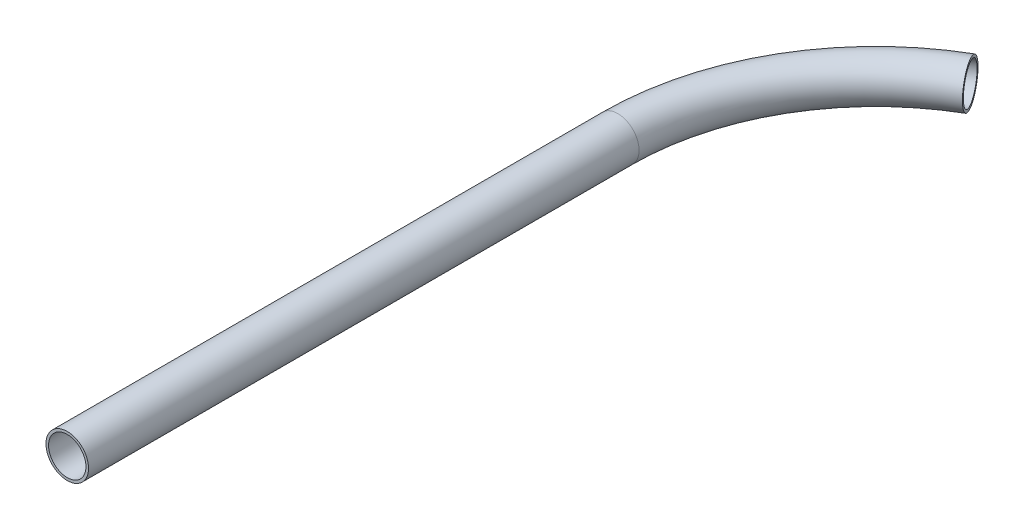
from build123d import *

# Parameters (mm, degrees)
ESQUISSE2_R   = 16.5
ESQUISSE2_R_2 = 14.5


with BuildPart() as part:
    # Balayage1: sweep along a path in Esquisse1
    with BuildLine(Plane(origin=(0, 0, 0), x_dir=(1, 0, 0), z_dir=(0, 1, 0))) as balayage1_path:
        Line((0, 0), (0, 426.794919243))
        ThreePointArc((0, 426.794919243), (26.794919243, 526.794919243), (100, 600))
    # Esquisse2 → Balayage1 (sweep)
    with BuildSketch(Plane.XY):
        Circle(ESQUISSE2_R)
        Circle(ESQUISSE2_R_2, mode=Mode.SUBTRACT)
    sweep(path=balayage1_path.line)


solid = part.part
